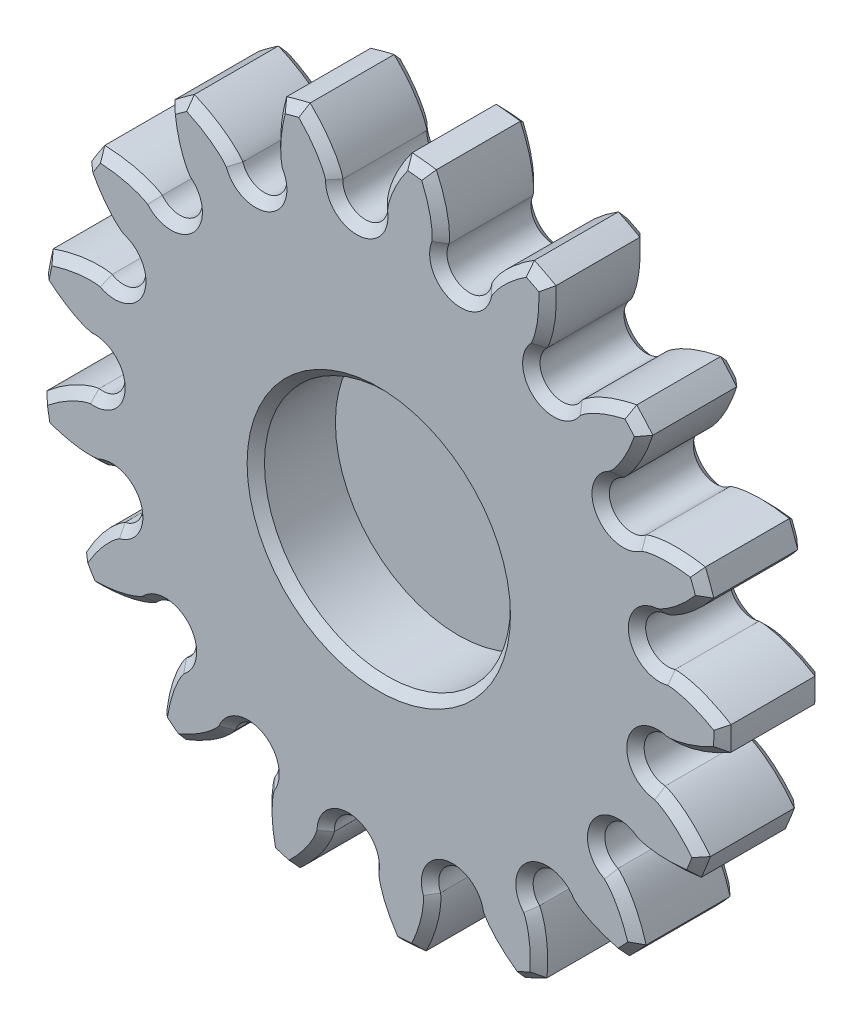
from build123d import *

# Parameters (mm, degrees)
BOSS_EXTRU_3_DEPTH           = 7
R_P_TITION_CIRCULAIRE1_COUNT = 17
ESQUISSE7_R                  = 8.5
ENL_V_MAT_EXTRU_3_DEPTH      = 5.5
ESQUISSE5_R                  = 5.8
BOSS_EXTRU_2_DEPTH           = 6
ESQUISSE8_R                  = 12.5
ESQUISSE8_R_2                = 7.8
ENL_V_MAT_EXTRU_4_DEPTH      = 1
CHANFREIN1_SIZE              = 0.6


with BuildPart() as part:
    # Esquisse6 → Boss.-Extru.3 (new body)
    with BuildSketch(Plane.XY):
        with BuildLine():
            Line((-0.1458993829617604, -1.3527023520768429), (5.460712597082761, 17.28283087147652))
            Line((5.460712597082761, 17.28283087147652), (5.221809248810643, 17.356506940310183))
            ThreePointArc((5.221809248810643, 17.356506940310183), (4.249944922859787, 18.209036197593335), (4.256358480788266, 19.50181818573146))
            add(Edge.make_bspline(
                [(4.256358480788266, 19.50181818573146), (4.259200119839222, 19.516302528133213), (4.266218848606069, 19.55710243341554), (4.2757261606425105, 19.634879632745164), (4.285849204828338, 19.762433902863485), (4.290823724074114, 19.925679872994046), (4.288110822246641, 20.13712581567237), (4.273191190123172, 20.386389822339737), (4.244477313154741, 20.660075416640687), (4.200062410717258, 20.957004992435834), (4.1440370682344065, 21.252228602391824), (4.077465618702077, 21.54528307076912), (4.001301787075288, 21.835926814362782), (3.8979570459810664, 22.185644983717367), (3.7577746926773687, 22.602379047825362), (3.610417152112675, 22.98409165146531), (3.479013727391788, 23.290800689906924), (3.3987839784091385, 23.467960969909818), (3.3803333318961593, 23.50820806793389)],
                knots=[0, 0, 0, 0, 0, 0.0053767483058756, 0.01508368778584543, 0.02853181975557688, 0.04661013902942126, 0.06485484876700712, 0.09211052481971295, 0.11947617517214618, 0.14684249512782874, 0.17420885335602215, 0.20157495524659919, 0.22894101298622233, 0.2563073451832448, 0.30703503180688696, 0.3617673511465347, 0.37789920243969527, 0.37789920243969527, 0.37789920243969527, 0.37789920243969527, 0.37789920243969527], degree=4))
            ThreePointArc((3.3803333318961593, 23.50820806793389), (2.546849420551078, 23.613048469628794), (1.7101791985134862, 23.68834707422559))
            add(Edge.make_bspline(
                [(0, 19.96089928), (0.00031228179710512, 19.975656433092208), (0.00215493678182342, 20.01701461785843), (0.0094510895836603, 20.09503030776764), (0.02675987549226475, 20.22180954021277), (0.05670948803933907, 20.38236175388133), (0.1044476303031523, 20.588366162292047), (0.17217588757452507, 20.828715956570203), (0.2585886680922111, 21.08998425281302), (0.365297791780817, 21.37061393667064), (0.4829865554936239, 21.64710114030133), (0.6105163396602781, 21.919220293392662), (0.7469038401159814, 22.18693873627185), (0.9224438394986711, 22.506577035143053), (1.1482643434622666, 22.883834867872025), (1.3736272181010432, 23.225346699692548), (1.5674095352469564, 23.496981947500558), (1.6835708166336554, 23.652959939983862), (1.7101791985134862, 23.68834707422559)],
                knots=[0, 0, 0, 0, 0, 0.0053767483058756, 0.01508368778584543, 0.02853181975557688, 0.04661013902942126, 0.06485484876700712, 0.09211052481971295, 0.11947617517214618, 0.14684249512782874, 0.17420885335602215, 0.20157495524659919, 0.22894101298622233, 0.2563073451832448, 0.30703503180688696, 0.3617673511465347, 0.37789920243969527, 0.37789920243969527, 0.37789920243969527, 0.37789920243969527, 0.37789920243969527], degree=4))
            ThreePointArc((0, 19.96089928), (-0.2694000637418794, 18.696482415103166), (-1.400701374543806, 18.070795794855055))
            Line((-1.400701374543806, 18.070795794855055), (-1.649820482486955, 18.049756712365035))
            Line((-1.649820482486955, 18.049756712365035), (-0.1458993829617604, -1.3527023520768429))
        make_face()
    boss_extru_3 = extrude(amount=BOSS_EXTRU_3_DEPTH)

    # R_p_tition circulaire1: Boss.-Extru.3 ×17 about axis
    r_p_tition_circulaire1_axis = Axis((0, 0, 0), (0, 0, -1))
    for i in range(1, R_P_TITION_CIRCULAIRE1_COUNT):
        add(boss_extru_3.rotate(r_p_tition_circulaire1_axis, i * 360 / R_P_TITION_CIRCULAIRE1_COUNT))

    # Esquisse7 → Enl_v. mat.-Extru.3 (cut)
    with BuildSketch(Plane.XY.offset(7)):
        Circle(ESQUISSE7_R)
    extrude(amount=-ENL_V_MAT_EXTRU_3_DEPTH, mode=Mode.SUBTRACT)

    # Esquisse5 → Boss.-Extru.2 (add)
    with BuildSketch(Plane(origin=(0, 0, 0), x_dir=(-1, 0, 0), z_dir=(0, 0, -1))):
        with Locations(Location((0, 0, 0), (0, 0, 180))):
            Circle(ESQUISSE5_R)
        with BuildLine():
            Line((2.0493901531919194, -1.5999999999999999), (-2.0493901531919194, -1.6000000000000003))
            ThreePointArc((-2.0493901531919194, -1.6000000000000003), (-2.5999999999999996, -8.4e-16), (-2.0493901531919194, 1.5999999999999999))
            Line((-2.0493901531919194, 1.5999999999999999), (2.0493901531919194, 1.5999999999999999))
            ThreePointArc((2.0493901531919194, 1.5999999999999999), (2.5999999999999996, 0), (2.0493901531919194, -1.5999999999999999))
        make_face(mode=Mode.SUBTRACT)
    extrude(amount=BOSS_EXTRU_2_DEPTH)

    # Esquisse8 → Enl_v. mat.-Extru.4 (cut)
    with BuildSketch(Plane(origin=(0, 0, 0), x_dir=(-1, 0, 0), z_dir=(0, 0, -1))):
        Circle(ESQUISSE8_R)
        Circle(ESQUISSE8_R_2, mode=Mode.SUBTRACT)
    extrude(amount=-ENL_V_MAT_EXTRU_4_DEPTH, mode=Mode.SUBTRACT)

    # Chanfrein1
    chanfrein1_edges = [part.edges().sort_by_distance(p)[0] for p in [
        (-2.5999999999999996, 1.1e-16, -6),
        (0, 1.5999999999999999, -6),
        (2.5999999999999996, -1.7e-16, -6),
        (0, -1.6, -6),
        (-5.8, -1.42e-15, -6),
        (4.0727065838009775, 21.55604051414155, 0),
        (2.546849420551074, 23.613048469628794, 0),
        (0.6174597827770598, 21.928715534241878, 0),
        (-1.4007013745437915, 18.070795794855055, 0),
        (-3.989254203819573, 21.571640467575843, 0),
        (-3.989254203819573, 21.571640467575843, 7),
        (-6.1551506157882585, 22.93854007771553, 0),
        (-6.1551506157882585, 22.93854007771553, 7),
        (-7.345801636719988, 20.670970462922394, 0),
        (-7.345801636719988, 20.670970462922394, 7),
        (-7.834039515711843, 16.34452354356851, 0),
        (-7.834039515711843, 16.34452354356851, 7),
        (-11.51244410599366, 18.67387084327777, 0),
        (-11.51244410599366, 18.67387084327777, 7),
        (-14.025863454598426, 19.16605474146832, 0),
        (-14.025863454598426, 19.16605474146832, 7),
        (-14.316971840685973, 16.621496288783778, 0),
        (-14.316971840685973, 16.621496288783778, 7),
        (-13.209347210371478, 12.410832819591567, 0),
        (-13.209347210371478, 12.410832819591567, 7),
        (-17.480814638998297, 13.254091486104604, 0),
        (-17.480814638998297, 13.254091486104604, 7),
        (-20.002305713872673, 12.805087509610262, 0),
        (-20.002305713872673, 12.805087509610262, 7),
        (-19.354555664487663, 10.327196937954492, 0),
        (-19.354555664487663, 10.327196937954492, 7),
        (-16.80065936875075, 6.800990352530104, 0),
        (-16.80065936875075, 6.800990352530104, 7),
        (-21.08830429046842, 6.044273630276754, 0),
        (-21.08830429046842, 6.044273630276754, 7),
        (-23.27732574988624, 4.714722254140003, 0),
        (-23.27732574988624, 4.714722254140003, 7),
        (-21.778199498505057, 2.638152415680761, 0),
        (-21.778199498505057, 2.638152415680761, 7),
        (-18.122949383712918, 0.27263645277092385, 0),
        (-18.122949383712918, 0.27263645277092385, 7),
        (-21.847701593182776, -1.9818568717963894, 0),
        (-21.847701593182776, -1.9818568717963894, 7),
        (-23.408613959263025, -4.012392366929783, 0),
        (-23.408613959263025, -4.012392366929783, 7),
        (-21.26057681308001, -5.407189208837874, 0),
        (-21.26057681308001, -5.407189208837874, 7),
        (-16.99763466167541, -6.2925385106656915, 0),
        (-16.99763466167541, -6.2925385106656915, 7),
        (-19.656445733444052, -9.740326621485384, 0),
        (-19.656445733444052, -9.740326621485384, 7),
        (-20.37843914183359, -12.197611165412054, 0),
        (-20.37843914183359, -12.197611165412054, 7),
        (-17.871595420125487, -12.7222599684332, 0),
        (-17.871595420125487, -12.7222599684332, 7),
        (-13.576695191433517, -12.007871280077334, 0),
        (-13.576695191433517, -12.007871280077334, 7),
        (-14.810477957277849, -16.183311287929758, 0),
        (-14.810477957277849, -16.183311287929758, 7),
        (-14.596043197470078, -18.735474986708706, 0),
        (-14.596043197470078, -18.735474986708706, 7),
        (-12.068956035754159, -18.31911902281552, 0),
        (-12.068956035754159, -18.31911902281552, 7),
        (-8.322147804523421, -16.101474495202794, 0),
        (-8.322147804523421, -16.101474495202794, 7),
        (-7.964273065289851, -20.44065009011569, 0),
        (-7.964273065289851, -20.44065009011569, 7),
        (-6.842370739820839, -22.74300909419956, 0),
        (-6.842370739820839, -22.74300909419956, 7),
        (-4.6363372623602, -21.441879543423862, 0),
        (-4.6363372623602, -21.441879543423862, 7),
        (-1.9436482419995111, -18.02048435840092, 0),
        (-1.9436482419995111, -18.02048435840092, 7),
        (-0.04244896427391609, -21.937365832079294, 0),
        (-0.04244896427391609, -21.937365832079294, 7),
        (1.8354018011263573, -23.678973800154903, 0),
        (1.8354018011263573, -23.678973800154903, 7),
        (3.4224445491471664, -21.66879541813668, 0),
        (3.4224445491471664, -21.66879541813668, 7),
        (4.697351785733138, -17.50572795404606, 0),
        (4.697351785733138, -17.50572795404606, 7),
        (7.885108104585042, -20.47131875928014, 0),
        (7.885108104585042, -20.47131875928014, 7),
        (10.265293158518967, -21.416961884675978, 0),
        (10.265293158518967, -21.416961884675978, 7),
        (11.019006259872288, -18.969220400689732, 0),
        (11.019006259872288, -18.969220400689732, 7),
        (10.70394842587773, -14.626725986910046, 0),
        (10.703948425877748, -14.626725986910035, 7),
        (14.747737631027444, -16.240506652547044, 0),
        (14.747737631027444, -16.240506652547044, 7),
        (17.308799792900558, -16.262470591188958, 0),
        (17.308799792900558, -16.262470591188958, 7),
        (17.127390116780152, -13.707747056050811, 0),
        (17.127390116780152, -13.707747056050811, 7),
        (15.264917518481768, -9.772303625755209, 0),
        (15.264917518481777, -9.772303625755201, 7),
        (19.618603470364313, -9.816324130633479, 0),
        (19.618603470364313, -9.816324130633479, 7),
        (22.014657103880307, -8.911642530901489, 0),
        (22.014657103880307, -8.911642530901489, 7),
        (20.922625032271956, -6.594966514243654, 0),
        (20.922625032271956, -6.594966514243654, 7),
        (17.764274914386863, -3.598077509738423, 0),
        (17.764274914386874, -3.5980775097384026, 7),
        (21.839868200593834, -2.0663926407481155, 0),
        (21.839868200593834, -2.0663926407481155, 7),
        (23.74731298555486, -0.35724776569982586, 0),
        (23.74731298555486, -0.35724776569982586, 7),
        (21.892143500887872, 1.408500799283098, 0),
        (21.892143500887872, 1.408500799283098, 7),
        (17.86446854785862, 3.0620889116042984, 0),
        (17.86446854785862, 3.062088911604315, 7),
        (21.11153771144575, 5.962616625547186, 0),
        (21.11153771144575, 5.962616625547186, 7),
        (22.272762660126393, 8.245395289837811, 0),
        (22.272762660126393, 8.245395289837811, 7),
        (19.90500668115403, 9.221742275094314, 0),
        (19.90500668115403, 9.221742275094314, 7),
        (15.551966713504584, 9.30870325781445, 0),
        (15.55196671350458, 9.308703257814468, 7),
        (17.531977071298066, 13.186341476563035, 0),
        (17.531977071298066, 13.186341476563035, 7),
        (17.790152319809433, 15.734452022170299, 0),
        (17.790152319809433, 15.734452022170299, 7),
        (15.229588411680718, 15.789536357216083, 0),
        (15.229588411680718, 15.789536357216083, 7),
        (11.139085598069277, 14.29812564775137, 0),
        (11.13908559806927, 14.298125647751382, 7),
        (11.584625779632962, 18.629177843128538, 0),
        (11.584625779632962, 18.629177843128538, 7),
        (10.904883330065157, 21.09848382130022, 0),
        (10.904883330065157, 21.09848382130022, 7),
        (8.497329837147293, 20.22486606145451, 0),
        (8.497329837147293, 20.22486606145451, 7),
        (5.221809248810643, 17.356506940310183, 0),
        (-1.4007013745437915, 18.070795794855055, 7),
        (0.6174597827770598, 21.928715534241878, 7),
        (2.546849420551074, 23.613048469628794, 7),
        (4.0727065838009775, 21.55604051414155, 7),
        (5.221809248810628, 17.35650694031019, 7),
        (-8.5, 1.04e-15, 7),
        (12.5, 1.53e-15, 0),
    ]]
    chamfer(chanfrein1_edges, length=CHANFREIN1_SIZE)


solid = part.part
